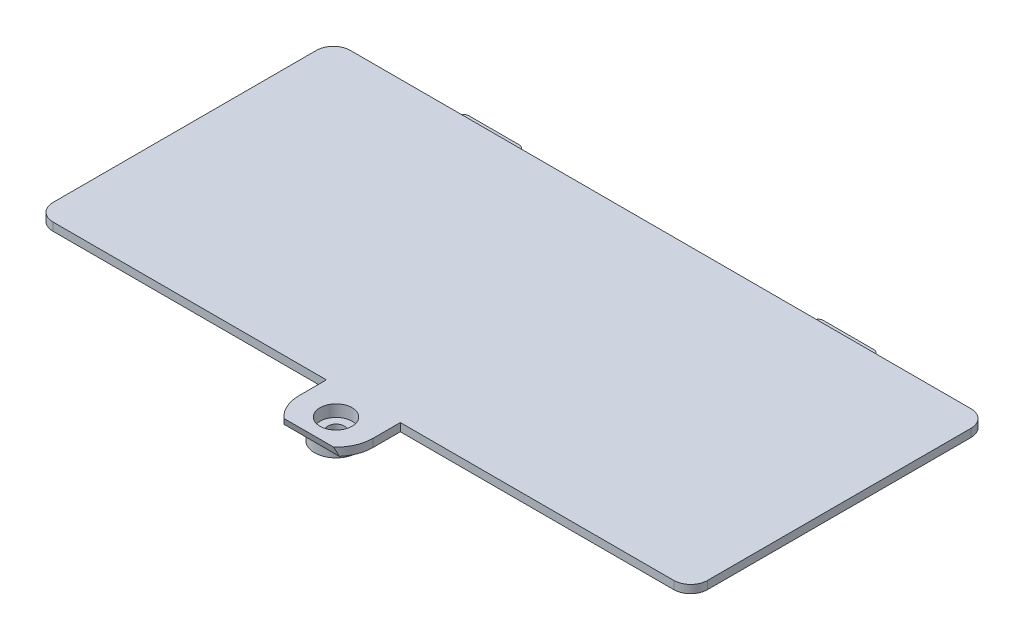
from build123d import *
from build123d.topology import SkipClean

# Parameters (mm, degrees)
ESQUISSE1_R             = 1.5
BOSS_EXTRU_1_DEPTH      = 1.5
ESQUISSE2_W             = 30
ESQUISSE2_H             = 15
BOSS_EXTRU_2_DEPTH      = 1.5
CONG_1_R                = 1
BOSS_EXTRU_3_DEPTH      = 1.5
BOSS_EXTRU_5_START      = 2.3
ESQUISSE6_R             = 4
ESQUISSE6_R_2           = 1.5
BOSS_EXTRU_5_DEPTH      = 2.3
ESQUISSE7_R             = 3
ENL_V_MAT_EXTRU_2_DEPTH = 2.2
CONG_2_R                = 1
ENL_V_MAT_EXTRU_3_DEPTH = 6


with BuildPart() as part:
    # Esquisse1 → Boss.-Extru.1 (new body)
    with BuildSketch(Plane(origin=(0, 0, 0), x_dir=(1, 0, 0), z_dir=(0, 1, 0))):
        with BuildLine():
            Line((6.9, -5.1), (6.9, 0))
            Line((6.9, 0), (57.95, 0))
            ThreePointArc((57.95, 0), (60.177386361, 0.922613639), (61.1, 3.15))
            Line((61.1, 3.15), (61.1, 52.35))
            ThreePointArc((61.1, 52.35), (60.177386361, 54.577386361), (57.95, 55.5))
            Line((57.95, 55.5), (-57.95, 55.5))
            ThreePointArc((-57.95, 55.5), (-60.177386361, 54.577386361), (-61.1, 52.35))
            Line((-61.1, 52.35), (-61.1, 3.15))
            ThreePointArc((-61.1, 3.15), (-60.177386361, 0.922613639), (-57.95, 0))
            Line((-57.95, 0), (-6.9, 0))
            Line((-6.9, 0), (-6.9, -5.1))
            ThreePointArc((-6.9, -5.1), (0, -12), (6.9, -5.1))
        make_face()
        with Locations(Location((0, -5.1, 0), (0, 0, 270))):
            Circle(ESQUISSE1_R, mode=Mode.SUBTRACT)
    extrude(amount=BOSS_EXTRU_1_DEPTH)

    # Esquisse2 → Boss.-Extru.2 (add)
    with BuildSketch(Plane.XZ):
        Polygon((-59.1, -26.35), (-48, -26.35), (-48, -11.35), (-59.1, -11.35), (-59.1, -9.85), (-48, -9.85), (-48, -2), (-46.5, -2), (-46.5, -9.85), (-16.5, -9.85), (-16.5, -2), (-15, -2), (-15, -9.85), (15, -9.85), (15, -2), (16.5, -2), (16.5, -9.85), (46.5, -9.85), (46.5, -2), (48, -2), (48, -9.85), (59.1, -9.85), (59.1, -11.35), (48, -11.35), (48, -26.35), (59.1, -26.35), (59.1, -27.85), (48, -27.85), (48, -42.85), (59.1, -42.85), (59.1, -44.35), (48, -44.35), (48, -52.2), (46.5, -52.2), (46.5, -44.35), (16.5, -44.35), (16.5, -52.2), (15, -52.2), (15, -44.35), (-15, -44.35), (-15, -52.2), (-16.5, -52.2), (-16.5, -44.35), (-46.5, -44.35), (-46.5, -52.2), (-48, -52.2), (-48, -44.35), (-59.1, -44.35), (-59.1, -42.85), (-48, -42.85), (-48, -27.85), (-59.1, -27.85), align=None)
        with Locations((-31.5, -35.35)):
            Rectangle(ESQUISSE2_W, ESQUISSE2_H, mode=Mode.SUBTRACT)
        with Locations((-31.5, -18.85)):
            Rectangle(ESQUISSE2_W, ESQUISSE2_H, mode=Mode.SUBTRACT)
        with Locations((0, -18.85)):
            Rectangle(ESQUISSE2_W, ESQUISSE2_H, mode=Mode.SUBTRACT)
        with Locations((0, -35.35)):
            Rectangle(ESQUISSE2_W, ESQUISSE2_H, mode=Mode.SUBTRACT)
        with Locations((31.5, -35.35)):
            Rectangle(ESQUISSE2_W, ESQUISSE2_H, mode=Mode.SUBTRACT)
        with Locations((31.5, -18.85)):
            Rectangle(ESQUISSE2_W, ESQUISSE2_H, mode=Mode.SUBTRACT)
    extrude(amount=BOSS_EXTRU_2_DEPTH)

    # Cong_1
    cong_1_edges = [part.edges().sort_by_distance(p)[0] for p in [
        (-59.1, -1.5, -10.6),
        (-59.1, -1.5, -27.1),
        (-59.1, -1.5, -43.6),
        (-47.25, -1.5, -52.2),
        (-15.75, -1.5, -52.2),
        (15.75, -1.5, -52.2),
        (47.25, -1.5, -52.2),
        (59.1, -1.5, -43.6),
        (59.1, -1.5, -27.1),
        (59.1, -1.5, -10.6),
        (47.25, -1.5, -2),
        (15.75, -1.5, -2),
        (-15.75, -1.5, -2),
        (-47.25, -1.5, -2),
    ]]
    fillet(cong_1_edges, radius=CONG_1_R)

    # Esquisse4 → Boss.-Extru.3 (add)
    with BuildSketch(Plane.XZ):
        with BuildLine():
            Line((27.4, -51.5), (27.4, -56.5))
            ThreePointArc((27.4, -56.5), (27.692893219, -57.207106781), (28.4, -57.5))
            Line((28.4, -57.5), (37.8, -57.5))
            ThreePointArc((37.8, -57.5), (38.507106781, -57.207106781), (38.8, -56.5))
            Line((38.8, -56.5), (38.8, -51.5))
            Line((38.8, -51.5), (27.4, -51.5))
        make_face()
        with BuildLine():
            Line((-38.8, -51.5), (-27.4, -51.5))
            Line((-27.4, -51.5), (-27.4, -56.5))
            ThreePointArc((-27.4, -56.5), (-27.692893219, -57.207106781), (-28.4, -57.5))
            Line((-28.4, -57.5), (-37.8, -57.5))
            ThreePointArc((-37.8, -57.5), (-38.507106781, -57.207106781), (-38.8, -56.5))
            Line((-38.8, -56.5), (-38.8, -51.5))
        make_face()
    extrude(amount=BOSS_EXTRU_3_DEPTH)

    # Esquisse6 → Boss.-Extru.5 (add)
    with SkipClean():  # the faces are left unmerged after this step: merging them gives an invalid solid
        with BuildSketch(Plane.XZ.offset(BOSS_EXTRU_5_START)):
            with Locations(Location((0, 5.1, 0), (0, 0, 90))):
                Circle(ESQUISSE6_R)
            with Locations(Location((0, 5.1, 0), (0, 0, 270))):
                Circle(ESQUISSE6_R_2, mode=Mode.SUBTRACT)
        extrude(amount=-BOSS_EXTRU_5_DEPTH)

    # Esquisse7 → Enl_v. mat.-Extru.2 (cut)
    with BuildSketch(Plane(origin=(0, 1.5, 0), x_dir=(1, 0, 0), z_dir=(0, 1, 0))):
        with Locations(Location((0, -5.1, 0), (0, 0, 270))):
            Circle(ESQUISSE7_R)
    extrude(amount=-ENL_V_MAT_EXTRU_2_DEPTH, mode=Mode.SUBTRACT)

    # Cong_2
    cong_2_edges = [part.edges().sort_by_distance(p)[0] for p in [
        (-33.1, -1.5, -51.5),
        (33.1, -1.5, -51.5),
    ]]
    fillet(cong_2_edges, radius=CONG_2_R)

    # Esquisse9 → Enl_v. mat.-Extru.3 (cut, symmetric)
    with BuildSketch(Plane(origin=(0, 0, 0), x_dir=(0, 0, -1), z_dir=(1, 0, 0))):
        Polygon((-9.654044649, 0), (-10.2, 1.5), (-12.126214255, 1.5), (-12.126214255, 0), align=None)
    extrude(amount=ENL_V_MAT_EXTRU_3_DEPTH, both=True, mode=Mode.SUBTRACT)


solid = part.part
